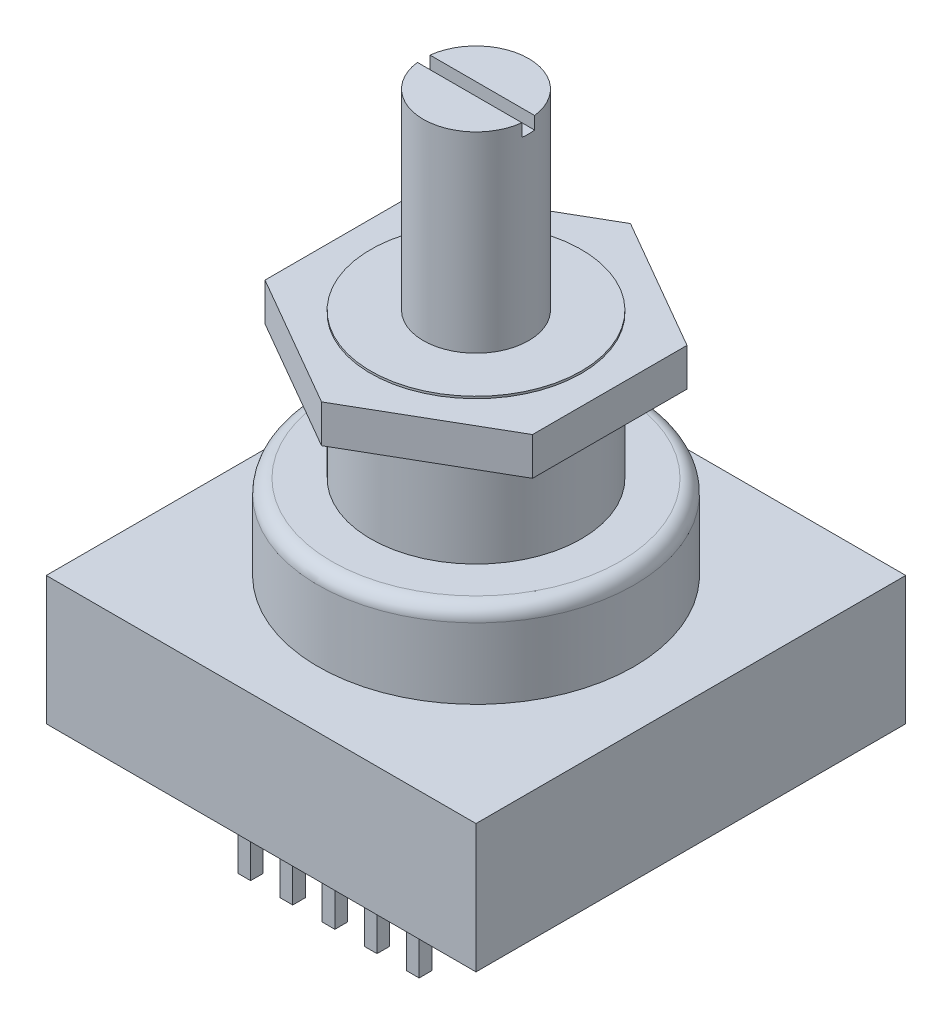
from build123d import *

# Parameters (mm, degrees)
SKETCH1_W          = 25.908
SKETCH1_H          = 25.908
EXTRUDE1_DEPTH     = 7.747
SKETCH2_W          = 0.762
SKETCH2_H          = 0.762
EXTRUDE3_DEPTH     = 6.096
EXTRUDE3_2_DEPTH   = 6.096
EXTRUDE3_3_DEPTH   = 6.096
EXTRUDE3_4_DEPTH   = 6.096
EXTRUDE3_5_DEPTH   = 6.096
EXTRUDE4_DEPTH     = 2.286
SKETCH6_W          = 8.853631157
SKETCH6_H          = 0.762
CUT_EXTRUDE1_DEPTH = 0.762


with BuildPart() as part:
    # Sketch1 → Extrude1 (new body)
    with BuildSketch(Plane(origin=(0, 0, 0), x_dir=(1, 0, 0), z_dir=(0, 1, 0))):
        Rectangle(SKETCH1_W, SKETCH1_H)
    extrude(amount=EXTRUDE1_DEPTH)


with BuildPart() as body_2:
    # Sketch2 → Extrude3 (new body)
    with BuildSketch(Plane.XZ):
        with Locations((0, 8.509)):
            Rectangle(SKETCH2_W, SKETCH2_H)
    extrude(amount=EXTRUDE3_DEPTH)


with BuildPart() as body_3:
    # Sketch2 → Extrude3 2 (new body)
    with BuildSketch(Plane.XZ):
        with Locations((2.54, 8.509)):
            Rectangle(SKETCH2_W, SKETCH2_H)
    extrude(amount=EXTRUDE3_2_DEPTH)


with BuildPart() as body_4:
    # Sketch2 → Extrude3 3 (new body)
    with BuildSketch(Plane.XZ):
        with Locations((5.08, 8.509)):
            Rectangle(SKETCH2_W, SKETCH2_H)
    extrude(amount=EXTRUDE3_3_DEPTH)


with BuildPart() as body_5:
    # Sketch2 → Extrude3 4 (new body)
    with BuildSketch(Plane.XZ):
        with Locations((-2.54, 8.509)):
            Rectangle(SKETCH2_W, SKETCH2_H)
    extrude(amount=EXTRUDE3_4_DEPTH)


with BuildPart() as body_6:
    # Sketch2 → Extrude3 5 (new body)
    with BuildSketch(Plane.XZ):
        with Locations((-5.08, 8.509)):
            Rectangle(SKETCH2_W, SKETCH2_H)
    extrude(amount=EXTRUDE3_5_DEPTH)


with BuildPart() as body_7:
    # Sketch4 → Revolve-Thin1 (revolve)
    with BuildSketch(Plane.XY):
        with BuildLine():
            Line((0, 33.147), (3.175, 33.147))
            Line((3.175, 33.147), (3.175, 21.59))
            Line((3.175, 21.59), (6.35, 21.59))
            Line((6.35, 21.59), (6.35, 12.827))
            Line((6.35, 12.827), (8.6995, 12.827))
            ThreePointArc((8.6995, 12.827), (9.283216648, 12.585216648), (9.525, 12.0015))
            Line((9.525, 12.0015), (9.525, 7.747))
            Line((9.525, 7.747), (8.525, 7.747))
            Line((8.525, 7.747), (8.525, 11.827))
            Line((8.525, 11.827), (5.35, 11.827))
            Line((5.35, 11.827), (5.35, 20.59))
            Line((5.35, 20.59), (2.175, 20.59))
            Line((2.175, 20.59), (2.175, 32.147))
            Line((2.175, 32.147), (0, 32.147))
            Line((0, 32.147), (0, 33.147))
        make_face()
    revolve(axis=Axis((0, 7.747, 0), (0, 1, 0)))

    # Sketch6 → Cut-Extrude1 (cut)
    with BuildSketch(Plane(origin=(0, 33.147, 0), x_dir=(1, 0, 0), z_dir=(0, 1, 0))):
        with Locations((0.29676976, 0)):
            Rectangle(SKETCH6_W, SKETCH6_H)
    extrude(amount=-CUT_EXTRUDE1_DEPTH, mode=Mode.SUBTRACT)


with BuildPart() as body_8:
    # Sketch5 → Extrude4 (new body)
    with BuildSketch(Plane(origin=(0, 19.177, 0), x_dir=(-1, 0, 0), z_dir=(0, 1, 0))):
        Polygon((0, 9.312082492), (-8.0645, 4.656041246), (-8.0645, -4.656041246), (0, -9.312082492), (8.0645, -4.656041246), (8.0645, 4.656041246), align=None)
    extrude(amount=EXTRUDE4_DEPTH)


solid = Compound([part.part, body_2.part, body_3.part, body_4.part, body_5.part, body_6.part, body_7.part, body_8.part])
